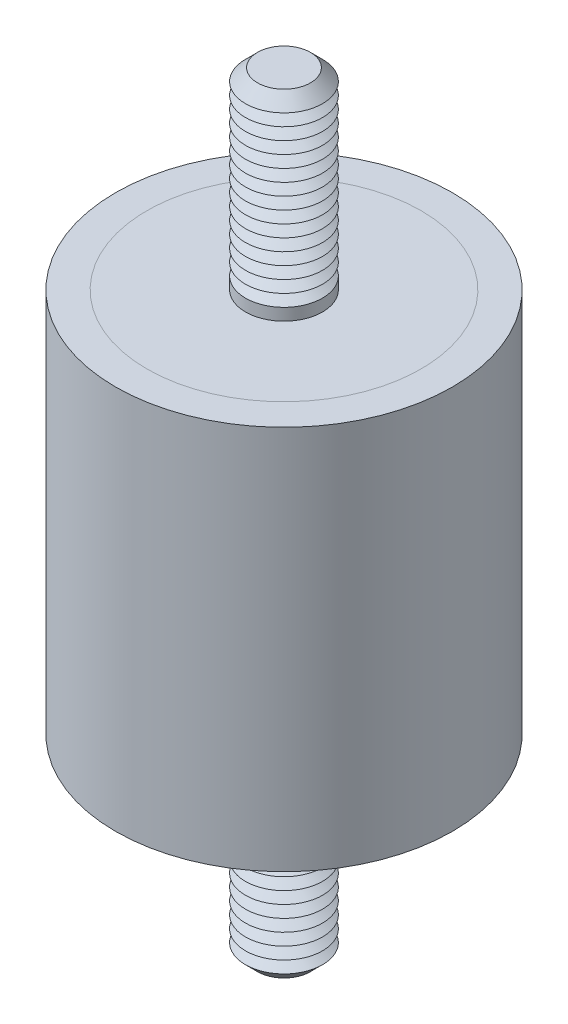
ISO-10303-21;
HEADER;
FILE_DESCRIPTION(('STEP AP214'),'2;1');
FILE_NAME('part.step','',(''),(''),'','','');
FILE_SCHEMA(('AUTOMOTIVE_DESIGN { 1 0 10303 214 1 1 1 1 }'));
ENDSEC;
DATA;
#1=APPLICATION_CONTEXT('core data for automotive mechanical design processes');
#2=APPLICATION_PROTOCOL_DEFINITION('international standard','automotive_design',2000,#1);
#3=PRODUCT_CONTEXT('',#1,'mechanical');
#4=PRODUCT('Part','Part','',(#3));
#5=PRODUCT_RELATED_PRODUCT_CATEGORY('part','',(#4));
#6=PRODUCT_DEFINITION_FORMATION('','',#4);
#7=PRODUCT_DEFINITION_CONTEXT('part definition',#1,'design');
#8=PRODUCT_DEFINITION('design','',#6,#7);
#9=PRODUCT_DEFINITION_SHAPE('','',#8);
#10=(LENGTH_UNIT() NAMED_UNIT(*) SI_UNIT(.MILLI.,.METRE.));
#11=(NAMED_UNIT(*) PLANE_ANGLE_UNIT() SI_UNIT($,.RADIAN.));
#12=(NAMED_UNIT(*) SI_UNIT($,.STERADIAN.) SOLID_ANGLE_UNIT());
#13=UNCERTAINTY_MEASURE_WITH_UNIT(LENGTH_MEASURE(1.E-05),#10,'distance_accuracy_value','');
#14=(GEOMETRIC_REPRESENTATION_CONTEXT(3) GLOBAL_UNCERTAINTY_ASSIGNED_CONTEXT((#13)) GLOBAL_UNIT_ASSIGNED_CONTEXT((#10,
#11,#12)) REPRESENTATION_CONTEXT('',''));
#15=CARTESIAN_POINT('',(0.,0.,0.));
#16=DIRECTION('',(0.,0.,1.));
#17=DIRECTION('',(1.,0.,0.));
#18=AXIS2_PLACEMENT_3D('',#15,#16,#17);
#19=CARTESIAN_POINT('',(0.,-40.,0.));
#20=DIRECTION('',(0.,1.,0.));
#21=DIRECTION('',(0.,0.,1.));
#22=AXIS2_PLACEMENT_3D('',#19,#20,#21);
#23=CYLINDRICAL_SURFACE('',#22,4.);
#24=CARTESIAN_POINT('',(0.,-20.,0.));
#25=DIRECTION('',(0.,-1.,0.));
#26=DIRECTION('',(0.,0.,-1.));
#27=AXIS2_PLACEMENT_3D('',#24,#25,#26);
#28=CIRCLE('',#27,4.);
#29=CARTESIAN_POINT('',(0.,-20.,-4.));
#30=VERTEX_POINT('',#29);
#31=EDGE_CURVE('P0_E21',#30,#30,#28,.T.);
#32=ORIENTED_EDGE('',*,*,#31,.T.);
#33=EDGE_LOOP('',(#32));
#34=FACE_BOUND('',#33,.T.);
#35=CARTESIAN_POINT('',(0.,-21.25,0.));
#36=DIRECTION('',(0.,1.,0.));
#37=DIRECTION('',(0.,0.,1.));
#38=AXIS2_PLACEMENT_3D('',#35,#36,#37);
#39=CIRCLE('',#38,4.);
#40=CARTESIAN_POINT('',(0.,-21.25,4.));
#41=VERTEX_POINT('',#40);
#42=EDGE_CURVE('P0_E33',#41,#41,#39,.T.);
#43=ORIENTED_EDGE('',*,*,#42,.T.);
#44=EDGE_LOOP('',(#43));
#45=FACE_BOUND('',#44,.T.);
#46=ADVANCED_FACE('P0_F14',(#34,#45),#23,.T.);
#47=CARTESIAN_POINT('',(0.,-20.,0.));
#48=DIRECTION('',(0.,1.,0.));
#49=DIRECTION('',(0.,0.,1.));
#50=AXIS2_PLACEMENT_3D('',#47,#48,#49);
#51=CYLINDRICAL_SURFACE('',#50,14.25);
#52=CARTESIAN_POINT('',(0.,-20.,0.));
#53=DIRECTION('',(0.,1.,0.));
#54=DIRECTION('',(0.,0.,1.));
#55=AXIS2_PLACEMENT_3D('',#52,#53,#54);
#56=CIRCLE('',#55,14.25);
#57=CARTESIAN_POINT('',(0.,-20.,14.25));
#58=VERTEX_POINT('',#57);
#59=EDGE_CURVE('P0_E25',#58,#58,#56,.T.);
#60=ORIENTED_EDGE('',*,*,#59,.T.);
#61=EDGE_LOOP('',(#60));
#62=FACE_BOUND('',#61,.T.);
#63=CARTESIAN_POINT('',(0.,-18.5,0.));
#64=DIRECTION('',(0.,1.,0.));
#65=DIRECTION('',(0.,0.,1.));
#66=AXIS2_PLACEMENT_3D('',#63,#64,#65);
#67=CIRCLE('',#66,14.25);
#68=CARTESIAN_POINT('',(0.,-18.5,14.25));
#69=VERTEX_POINT('',#68);
#70=EDGE_CURVE('P0_E30',#69,#69,#67,.T.);
#71=ORIENTED_EDGE('',*,*,#70,.F.);
#72=EDGE_LOOP('',(#71));
#73=FACE_BOUND('',#72,.T.);
#74=ADVANCED_FACE('P0_F145',(#62,#73),#51,.T.);
#75=CARTESIAN_POINT('',(0.,-20.,0.));
#76=DIRECTION('',(0.,1.,0.));
#77=DIRECTION('',(0.,0.,1.));
#78=AXIS2_PLACEMENT_3D('',#75,#76,#77);
#79=PLANE('',#78);
#80=ORIENTED_EDGE('',*,*,#31,.F.);
#81=EDGE_LOOP('',(#80));
#82=FACE_BOUND('',#81,.T.);
#83=ORIENTED_EDGE('',*,*,#59,.F.);
#84=EDGE_LOOP('',(#83));
#85=FACE_BOUND('',#84,.T.);
#86=ADVANCED_FACE('P0_F150',(#82,#85),#79,.F.);
#87=CARTESIAN_POINT('',(0.,-18.5,0.));
#88=DIRECTION('',(0.,1.,0.));
#89=DIRECTION('',(0.,0.,1.));
#90=AXIS2_PLACEMENT_3D('',#87,#88,#89);
#91=PLANE('',#90);
#92=ORIENTED_EDGE('',*,*,#70,.T.);
#93=EDGE_LOOP('',(#92));
#94=FACE_BOUND('',#93,.T.);
#95=ADVANCED_FACE('P0_F156',(#94),#91,.T.);
#96=CARTESIAN_POINT('',(0.,-21.25,0.));
#97=DIRECTION('',(0.,1.,0.));
#98=DIRECTION('',(0.,0.,1.));
#99=AXIS2_PLACEMENT_3D('',#96,#97,#98);
#100=CONICAL_SURFACE('',#99,4.,1.0471975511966);
#101=CARTESIAN_POINT('',(0.,-21.875,0.));
#102=DIRECTION('',(0.,1.,0.));
#103=DIRECTION('',(0.,0.,1.));
#104=AXIS2_PLACEMENT_3D('',#101,#102,#103);
#105=CIRCLE('',#104,2.91746824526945);
#106=CARTESIAN_POINT('',(0.,-21.875,2.91746824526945));
#107=VERTEX_POINT('',#106);
#108=EDGE_CURVE('P0_E39',#107,#107,#105,.T.);
#109=ORIENTED_EDGE('',*,*,#108,.T.);
#110=EDGE_LOOP('',(#109));
#111=FACE_BOUND('',#110,.T.);
#112=ORIENTED_EDGE('',*,*,#42,.F.);
#113=EDGE_LOOP('',(#112));
#114=FACE_BOUND('',#113,.T.);
#115=ADVANCED_FACE('P0_F159',(#111,#114),#100,.T.);
#116=CARTESIAN_POINT('',(0.,-21.875,0.));
#117=DIRECTION('',(0.,-1.,0.));
#118=DIRECTION('',(0.,0.,-1.));
#119=AXIS2_PLACEMENT_3D('',#116,#117,#118);
#120=CONICAL_SURFACE('',#119,2.91746824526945,1.04719755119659);
#121=CARTESIAN_POINT('',(0.,-22.5,0.));
#122=DIRECTION('',(0.,1.,0.));
#123=DIRECTION('',(0.,0.,1.));
#124=AXIS2_PLACEMENT_3D('',#121,#122,#123);
#125=CIRCLE('',#124,4.);
#126=CARTESIAN_POINT('',(0.,-22.5,4.));
#127=VERTEX_POINT('',#126);
#128=EDGE_CURVE('P0_E43',#127,#127,#125,.T.);
#129=ORIENTED_EDGE('',*,*,#128,.T.);
#130=EDGE_LOOP('',(#129));
#131=FACE_BOUND('',#130,.T.);
#132=ORIENTED_EDGE('',*,*,#108,.F.);
#133=EDGE_LOOP('',(#132));
#134=FACE_BOUND('',#133,.T.);
#135=ADVANCED_FACE('P0_F163',(#131,#134),#120,.T.);
#136=CARTESIAN_POINT('',(0.,-22.5,0.));
#137=DIRECTION('',(0.,1.,0.));
#138=DIRECTION('',(0.,0.,1.));
#139=AXIS2_PLACEMENT_3D('',#136,#137,#138);
#140=CONICAL_SURFACE('',#139,4.,1.0471975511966);
#141=CARTESIAN_POINT('',(0.,-23.125,0.));
#142=DIRECTION('',(0.,1.,0.));
#143=DIRECTION('',(0.,0.,1.));
#144=AXIS2_PLACEMENT_3D('',#141,#142,#143);
#145=CIRCLE('',#144,2.91746824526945);
#146=CARTESIAN_POINT('',(0.,-23.125,2.91746824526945));
#147=VERTEX_POINT('',#146);
#148=EDGE_CURVE('P0_E47',#147,#147,#145,.T.);
#149=ORIENTED_EDGE('',*,*,#148,.T.);
#150=EDGE_LOOP('',(#149));
#151=FACE_BOUND('',#150,.T.);
#152=ORIENTED_EDGE('',*,*,#128,.F.);
#153=EDGE_LOOP('',(#152));
#154=FACE_BOUND('',#153,.T.);
#155=ADVANCED_FACE('P0_F167',(#151,#154),#140,.T.);
#156=CARTESIAN_POINT('',(0.,-23.125,0.));
#157=DIRECTION('',(0.,-1.,0.));
#158=DIRECTION('',(0.,0.,-1.));
#159=AXIS2_PLACEMENT_3D('',#156,#157,#158);
#160=CONICAL_SURFACE('',#159,2.91746824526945,1.04719755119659);
#161=CARTESIAN_POINT('',(0.,-23.75,0.));
#162=DIRECTION('',(0.,1.,0.));
#163=DIRECTION('',(0.,0.,1.));
#164=AXIS2_PLACEMENT_3D('',#161,#162,#163);
#165=CIRCLE('',#164,4.);
#166=CARTESIAN_POINT('',(0.,-23.75,4.));
#167=VERTEX_POINT('',#166);
#168=EDGE_CURVE('P0_E52',#167,#167,#165,.T.);
#169=ORIENTED_EDGE('',*,*,#168,.T.);
#170=EDGE_LOOP('',(#169));
#171=FACE_BOUND('',#170,.T.);
#172=ORIENTED_EDGE('',*,*,#148,.F.);
#173=EDGE_LOOP('',(#172));
#174=FACE_BOUND('',#173,.T.);
#175=ADVANCED_FACE('P0_F174',(#171,#174),#160,.T.);
#176=CARTESIAN_POINT('',(0.,-23.75,0.));
#177=DIRECTION('',(0.,1.,0.));
#178=DIRECTION('',(0.,0.,1.));
#179=AXIS2_PLACEMENT_3D('',#176,#177,#178);
#180=CONICAL_SURFACE('',#179,4.,1.0471975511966);
#181=CARTESIAN_POINT('',(0.,-24.375,0.));
#182=DIRECTION('',(0.,1.,0.));
#183=DIRECTION('',(0.,0.,1.));
#184=AXIS2_PLACEMENT_3D('',#181,#182,#183);
#185=CIRCLE('',#184,2.91746824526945);
#186=CARTESIAN_POINT('',(0.,-24.375,2.91746824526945));
#187=VERTEX_POINT('',#186);
#188=EDGE_CURVE('P0_E55',#187,#187,#185,.T.);
#189=ORIENTED_EDGE('',*,*,#188,.T.);
#190=EDGE_LOOP('',(#189));
#191=FACE_BOUND('',#190,.T.);
#192=ORIENTED_EDGE('',*,*,#168,.F.);
#193=EDGE_LOOP('',(#192));
#194=FACE_BOUND('',#193,.T.);
#195=ADVANCED_FACE('P0_F178',(#191,#194),#180,.T.);
#196=CARTESIAN_POINT('',(0.,-24.375,0.));
#197=DIRECTION('',(0.,-1.,0.));
#198=DIRECTION('',(0.,0.,-1.));
#199=AXIS2_PLACEMENT_3D('',#196,#197,#198);
#200=CONICAL_SURFACE('',#199,2.91746824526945,1.04719755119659);
#201=CARTESIAN_POINT('',(0.,-25.,0.));
#202=DIRECTION('',(0.,1.,0.));
#203=DIRECTION('',(0.,0.,1.));
#204=AXIS2_PLACEMENT_3D('',#201,#202,#203);
#205=CIRCLE('',#204,4.);
#206=CARTESIAN_POINT('',(0.,-25.,4.));
#207=VERTEX_POINT('',#206);
#208=EDGE_CURVE('P0_E58',#207,#207,#205,.T.);
#209=ORIENTED_EDGE('',*,*,#208,.T.);
#210=EDGE_LOOP('',(#209));
#211=FACE_BOUND('',#210,.T.);
#212=ORIENTED_EDGE('',*,*,#188,.F.);
#213=EDGE_LOOP('',(#212));
#214=FACE_BOUND('',#213,.T.);
#215=ADVANCED_FACE('P0_F182',(#211,#214),#200,.T.);
#216=CARTESIAN_POINT('',(0.,-25.,0.));
#217=DIRECTION('',(0.,1.,0.));
#218=DIRECTION('',(0.,0.,1.));
#219=AXIS2_PLACEMENT_3D('',#216,#217,#218);
#220=CONICAL_SURFACE('',#219,4.,1.0471975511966);
#221=CARTESIAN_POINT('',(0.,-25.625,0.));
#222=DIRECTION('',(0.,1.,0.));
#223=DIRECTION('',(0.,0.,1.));
#224=AXIS2_PLACEMENT_3D('',#221,#222,#223);
#225=CIRCLE('',#224,2.91746824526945);
#226=CARTESIAN_POINT('',(0.,-25.625,2.91746824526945));
#227=VERTEX_POINT('',#226);
#228=EDGE_CURVE('P0_E61',#227,#227,#225,.T.);
#229=ORIENTED_EDGE('',*,*,#228,.T.);
#230=EDGE_LOOP('',(#229));
#231=FACE_BOUND('',#230,.T.);
#232=ORIENTED_EDGE('',*,*,#208,.F.);
#233=EDGE_LOOP('',(#232));
#234=FACE_BOUND('',#233,.T.);
#235=ADVANCED_FACE('P0_F186',(#231,#234),#220,.T.);
#236=CARTESIAN_POINT('',(0.,-25.625,0.));
#237=DIRECTION('',(0.,-1.,0.));
#238=DIRECTION('',(0.,0.,-1.));
#239=AXIS2_PLACEMENT_3D('',#236,#237,#238);
#240=CONICAL_SURFACE('',#239,2.91746824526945,1.04719755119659);
#241=CARTESIAN_POINT('',(0.,-26.25,0.));
#242=DIRECTION('',(0.,1.,0.));
#243=DIRECTION('',(0.,0.,1.));
#244=AXIS2_PLACEMENT_3D('',#241,#242,#243);
#245=CIRCLE('',#244,4.);
#246=CARTESIAN_POINT('',(0.,-26.25,4.));
#247=VERTEX_POINT('',#246);
#248=EDGE_CURVE('P0_E64',#247,#247,#245,.T.);
#249=ORIENTED_EDGE('',*,*,#248,.T.);
#250=EDGE_LOOP('',(#249));
#251=FACE_BOUND('',#250,.T.);
#252=ORIENTED_EDGE('',*,*,#228,.F.);
#253=EDGE_LOOP('',(#252));
#254=FACE_BOUND('',#253,.T.);
#255=ADVANCED_FACE('P0_F190',(#251,#254),#240,.T.);
#256=CARTESIAN_POINT('',(0.,-26.25,0.));
#257=DIRECTION('',(0.,1.,0.));
#258=DIRECTION('',(0.,0.,1.));
#259=AXIS2_PLACEMENT_3D('',#256,#257,#258);
#260=CONICAL_SURFACE('',#259,4.,1.0471975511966);
#261=CARTESIAN_POINT('',(0.,-26.875,0.));
#262=DIRECTION('',(0.,1.,0.));
#263=DIRECTION('',(0.,0.,1.));
#264=AXIS2_PLACEMENT_3D('',#261,#262,#263);
#265=CIRCLE('',#264,2.91746824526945);
#266=CARTESIAN_POINT('',(0.,-26.875,2.91746824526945));
#267=VERTEX_POINT('',#266);
#268=EDGE_CURVE('P0_E67',#267,#267,#265,.T.);
#269=ORIENTED_EDGE('',*,*,#268,.T.);
#270=EDGE_LOOP('',(#269));
#271=FACE_BOUND('',#270,.T.);
#272=ORIENTED_EDGE('',*,*,#248,.F.);
#273=EDGE_LOOP('',(#272));
#274=FACE_BOUND('',#273,.T.);
#275=ADVANCED_FACE('P0_F194',(#271,#274),#260,.T.);
#276=CARTESIAN_POINT('',(0.,-26.875,0.));
#277=DIRECTION('',(0.,-1.,0.));
#278=DIRECTION('',(0.,0.,-1.));
#279=AXIS2_PLACEMENT_3D('',#276,#277,#278);
#280=CONICAL_SURFACE('',#279,2.91746824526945,1.04719755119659);
#281=CARTESIAN_POINT('',(0.,-27.5,0.));
#282=DIRECTION('',(0.,1.,0.));
#283=DIRECTION('',(0.,0.,1.));
#284=AXIS2_PLACEMENT_3D('',#281,#282,#283);
#285=CIRCLE('',#284,4.);
#286=CARTESIAN_POINT('',(0.,-27.5,4.));
#287=VERTEX_POINT('',#286);
#288=EDGE_CURVE('P0_E70',#287,#287,#285,.T.);
#289=ORIENTED_EDGE('',*,*,#288,.T.);
#290=EDGE_LOOP('',(#289));
#291=FACE_BOUND('',#290,.T.);
#292=ORIENTED_EDGE('',*,*,#268,.F.);
#293=EDGE_LOOP('',(#292));
#294=FACE_BOUND('',#293,.T.);
#295=ADVANCED_FACE('P0_F198',(#291,#294),#280,.T.);
#296=CARTESIAN_POINT('',(0.,-27.5,0.));
#297=DIRECTION('',(0.,1.,0.));
#298=DIRECTION('',(0.,0.,1.));
#299=AXIS2_PLACEMENT_3D('',#296,#297,#298);
#300=CONICAL_SURFACE('',#299,4.,1.0471975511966);
#301=CARTESIAN_POINT('',(0.,-28.125,0.));
#302=DIRECTION('',(0.,1.,0.));
#303=DIRECTION('',(0.,0.,1.));
#304=AXIS2_PLACEMENT_3D('',#301,#302,#303);
#305=CIRCLE('',#304,2.91746824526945);
#306=CARTESIAN_POINT('',(0.,-28.125,2.91746824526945));
#307=VERTEX_POINT('',#306);
#308=EDGE_CURVE('P0_E73',#307,#307,#305,.T.);
#309=ORIENTED_EDGE('',*,*,#308,.T.);
#310=EDGE_LOOP('',(#309));
#311=FACE_BOUND('',#310,.T.);
#312=ORIENTED_EDGE('',*,*,#288,.F.);
#313=EDGE_LOOP('',(#312));
#314=FACE_BOUND('',#313,.T.);
#315=ADVANCED_FACE('P0_F202',(#311,#314),#300,.T.);
#316=CARTESIAN_POINT('',(0.,-28.125,0.));
#317=DIRECTION('',(0.,-1.,0.));
#318=DIRECTION('',(0.,0.,-1.));
#319=AXIS2_PLACEMENT_3D('',#316,#317,#318);
#320=CONICAL_SURFACE('',#319,2.91746824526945,1.04719755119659);
#321=CARTESIAN_POINT('',(0.,-28.75,0.));
#322=DIRECTION('',(0.,1.,0.));
#323=DIRECTION('',(0.,0.,1.));
#324=AXIS2_PLACEMENT_3D('',#321,#322,#323);
#325=CIRCLE('',#324,4.);
#326=CARTESIAN_POINT('',(0.,-28.75,4.));
#327=VERTEX_POINT('',#326);
#328=EDGE_CURVE('P0_E76',#327,#327,#325,.T.);
#329=ORIENTED_EDGE('',*,*,#328,.T.);
#330=EDGE_LOOP('',(#329));
#331=FACE_BOUND('',#330,.T.);
#332=ORIENTED_EDGE('',*,*,#308,.F.);
#333=EDGE_LOOP('',(#332));
#334=FACE_BOUND('',#333,.T.);
#335=ADVANCED_FACE('P0_F206',(#331,#334),#320,.T.);
#336=CARTESIAN_POINT('',(0.,-28.75,0.));
#337=DIRECTION('',(0.,1.,0.));
#338=DIRECTION('',(0.,0.,1.));
#339=AXIS2_PLACEMENT_3D('',#336,#337,#338);
#340=CONICAL_SURFACE('',#339,4.,1.0471975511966);
#341=CARTESIAN_POINT('',(0.,-29.375,0.));
#342=DIRECTION('',(0.,1.,0.));
#343=DIRECTION('',(0.,0.,1.));
#344=AXIS2_PLACEMENT_3D('',#341,#342,#343);
#345=CIRCLE('',#344,2.91746824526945);
#346=CARTESIAN_POINT('',(0.,-29.375,2.91746824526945));
#347=VERTEX_POINT('',#346);
#348=EDGE_CURVE('P0_E79',#347,#347,#345,.T.);
#349=ORIENTED_EDGE('',*,*,#348,.T.);
#350=EDGE_LOOP('',(#349));
#351=FACE_BOUND('',#350,.T.);
#352=ORIENTED_EDGE('',*,*,#328,.F.);
#353=EDGE_LOOP('',(#352));
#354=FACE_BOUND('',#353,.T.);
#355=ADVANCED_FACE('P0_F210',(#351,#354),#340,.T.);
#356=CARTESIAN_POINT('',(0.,-29.375,0.));
#357=DIRECTION('',(0.,-1.,0.));
#358=DIRECTION('',(0.,0.,-1.));
#359=AXIS2_PLACEMENT_3D('',#356,#357,#358);
#360=CONICAL_SURFACE('',#359,2.91746824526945,1.04719755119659);
#361=CARTESIAN_POINT('',(0.,-30.,0.));
#362=DIRECTION('',(0.,1.,0.));
#363=DIRECTION('',(0.,0.,1.));
#364=AXIS2_PLACEMENT_3D('',#361,#362,#363);
#365=CIRCLE('',#364,4.);
#366=CARTESIAN_POINT('',(0.,-30.,4.));
#367=VERTEX_POINT('',#366);
#368=EDGE_CURVE('P0_E82',#367,#367,#365,.T.);
#369=ORIENTED_EDGE('',*,*,#368,.T.);
#370=EDGE_LOOP('',(#369));
#371=FACE_BOUND('',#370,.T.);
#372=ORIENTED_EDGE('',*,*,#348,.F.);
#373=EDGE_LOOP('',(#372));
#374=FACE_BOUND('',#373,.T.);
#375=ADVANCED_FACE('P0_F214',(#371,#374),#360,.T.);
#376=CARTESIAN_POINT('',(0.,-30.,0.));
#377=DIRECTION('',(0.,1.,0.));
#378=DIRECTION('',(0.,0.,1.));
#379=AXIS2_PLACEMENT_3D('',#376,#377,#378);
#380=CONICAL_SURFACE('',#379,4.,1.0471975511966);
#381=CARTESIAN_POINT('',(0.,-30.625,0.));
#382=DIRECTION('',(0.,1.,0.));
#383=DIRECTION('',(0.,0.,1.));
#384=AXIS2_PLACEMENT_3D('',#381,#382,#383);
#385=CIRCLE('',#384,2.91746824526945);
#386=CARTESIAN_POINT('',(0.,-30.625,2.91746824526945));
#387=VERTEX_POINT('',#386);
#388=EDGE_CURVE('P0_E85',#387,#387,#385,.T.);
#389=ORIENTED_EDGE('',*,*,#388,.T.);
#390=EDGE_LOOP('',(#389));
#391=FACE_BOUND('',#390,.T.);
#392=ORIENTED_EDGE('',*,*,#368,.F.);
#393=EDGE_LOOP('',(#392));
#394=FACE_BOUND('',#393,.T.);
#395=ADVANCED_FACE('P0_F218',(#391,#394),#380,.T.);
#396=CARTESIAN_POINT('',(0.,-30.625,0.));
#397=DIRECTION('',(0.,-1.,0.));
#398=DIRECTION('',(0.,0.,-1.));
#399=AXIS2_PLACEMENT_3D('',#396,#397,#398);
#400=CONICAL_SURFACE('',#399,2.91746824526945,1.04719755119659);
#401=CARTESIAN_POINT('',(0.,-31.25,0.));
#402=DIRECTION('',(0.,1.,0.));
#403=DIRECTION('',(0.,0.,1.));
#404=AXIS2_PLACEMENT_3D('',#401,#402,#403);
#405=CIRCLE('',#404,4.);
#406=CARTESIAN_POINT('',(0.,-31.25,4.));
#407=VERTEX_POINT('',#406);
#408=EDGE_CURVE('P0_E88',#407,#407,#405,.T.);
#409=ORIENTED_EDGE('',*,*,#408,.T.);
#410=EDGE_LOOP('',(#409));
#411=FACE_BOUND('',#410,.T.);
#412=ORIENTED_EDGE('',*,*,#388,.F.);
#413=EDGE_LOOP('',(#412));
#414=FACE_BOUND('',#413,.T.);
#415=ADVANCED_FACE('P0_F222',(#411,#414),#400,.T.);
#416=CARTESIAN_POINT('',(0.,-31.25,0.));
#417=DIRECTION('',(0.,1.,0.));
#418=DIRECTION('',(0.,0.,1.));
#419=AXIS2_PLACEMENT_3D('',#416,#417,#418);
#420=CONICAL_SURFACE('',#419,4.,1.0471975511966);
#421=CARTESIAN_POINT('',(0.,-31.875,0.));
#422=DIRECTION('',(0.,1.,0.));
#423=DIRECTION('',(0.,0.,1.));
#424=AXIS2_PLACEMENT_3D('',#421,#422,#423);
#425=CIRCLE('',#424,2.91746824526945);
#426=CARTESIAN_POINT('',(0.,-31.875,2.91746824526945));
#427=VERTEX_POINT('',#426);
#428=EDGE_CURVE('P0_E91',#427,#427,#425,.T.);
#429=ORIENTED_EDGE('',*,*,#428,.T.);
#430=EDGE_LOOP('',(#429));
#431=FACE_BOUND('',#430,.T.);
#432=ORIENTED_EDGE('',*,*,#408,.F.);
#433=EDGE_LOOP('',(#432));
#434=FACE_BOUND('',#433,.T.);
#435=ADVANCED_FACE('P0_F226',(#431,#434),#420,.T.);
#436=CARTESIAN_POINT('',(0.,-31.875,0.));
#437=DIRECTION('',(0.,-1.,0.));
#438=DIRECTION('',(0.,0.,-1.));
#439=AXIS2_PLACEMENT_3D('',#436,#437,#438);
#440=CONICAL_SURFACE('',#439,2.91746824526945,1.04719755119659);
#441=CARTESIAN_POINT('',(0.,-32.5,0.));
#442=DIRECTION('',(0.,1.,0.));
#443=DIRECTION('',(0.,0.,1.));
#444=AXIS2_PLACEMENT_3D('',#441,#442,#443);
#445=CIRCLE('',#444,4.);
#446=CARTESIAN_POINT('',(0.,-32.5,4.));
#447=VERTEX_POINT('',#446);
#448=EDGE_CURVE('P0_E94',#447,#447,#445,.T.);
#449=ORIENTED_EDGE('',*,*,#448,.T.);
#450=EDGE_LOOP('',(#449));
#451=FACE_BOUND('',#450,.T.);
#452=ORIENTED_EDGE('',*,*,#428,.F.);
#453=EDGE_LOOP('',(#452));
#454=FACE_BOUND('',#453,.T.);
#455=ADVANCED_FACE('P0_F230',(#451,#454),#440,.T.);
#456=CARTESIAN_POINT('',(0.,-32.5,0.));
#457=DIRECTION('',(0.,1.,0.));
#458=DIRECTION('',(0.,0.,1.));
#459=AXIS2_PLACEMENT_3D('',#456,#457,#458);
#460=CONICAL_SURFACE('',#459,4.,1.0471975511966);
#461=CARTESIAN_POINT('',(0.,-33.125,0.));
#462=DIRECTION('',(0.,1.,0.));
#463=DIRECTION('',(0.,0.,1.));
#464=AXIS2_PLACEMENT_3D('',#461,#462,#463);
#465=CIRCLE('',#464,2.91746824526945);
#466=CARTESIAN_POINT('',(0.,-33.125,2.91746824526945));
#467=VERTEX_POINT('',#466);
#468=EDGE_CURVE('P0_E97',#467,#467,#465,.T.);
#469=ORIENTED_EDGE('',*,*,#468,.T.);
#470=EDGE_LOOP('',(#469));
#471=FACE_BOUND('',#470,.T.);
#472=ORIENTED_EDGE('',*,*,#448,.F.);
#473=EDGE_LOOP('',(#472));
#474=FACE_BOUND('',#473,.T.);
#475=ADVANCED_FACE('P0_F234',(#471,#474),#460,.T.);
#476=CARTESIAN_POINT('',(0.,-33.125,0.));
#477=DIRECTION('',(0.,-1.,0.));
#478=DIRECTION('',(0.,0.,-1.));
#479=AXIS2_PLACEMENT_3D('',#476,#477,#478);
#480=CONICAL_SURFACE('',#479,2.91746824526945,1.04719755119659);
#481=CARTESIAN_POINT('',(0.,-33.75,0.));
#482=DIRECTION('',(0.,1.,0.));
#483=DIRECTION('',(0.,0.,1.));
#484=AXIS2_PLACEMENT_3D('',#481,#482,#483);
#485=CIRCLE('',#484,4.);
#486=CARTESIAN_POINT('',(0.,-33.75,4.));
#487=VERTEX_POINT('',#486);
#488=EDGE_CURVE('P0_E100',#487,#487,#485,.T.);
#489=ORIENTED_EDGE('',*,*,#488,.T.);
#490=EDGE_LOOP('',(#489));
#491=FACE_BOUND('',#490,.T.);
#492=ORIENTED_EDGE('',*,*,#468,.F.);
#493=EDGE_LOOP('',(#492));
#494=FACE_BOUND('',#493,.T.);
#495=ADVANCED_FACE('P0_F238',(#491,#494),#480,.T.);
#496=CARTESIAN_POINT('',(0.,-33.75,0.));
#497=DIRECTION('',(0.,1.,0.));
#498=DIRECTION('',(0.,0.,1.));
#499=AXIS2_PLACEMENT_3D('',#496,#497,#498);
#500=CONICAL_SURFACE('',#499,4.,1.0471975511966);
#501=CARTESIAN_POINT('',(0.,-34.375,0.));
#502=DIRECTION('',(0.,1.,0.));
#503=DIRECTION('',(0.,0.,1.));
#504=AXIS2_PLACEMENT_3D('',#501,#502,#503);
#505=CIRCLE('',#504,2.91746824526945);
#506=CARTESIAN_POINT('',(0.,-34.375,2.91746824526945));
#507=VERTEX_POINT('',#506);
#508=EDGE_CURVE('P0_E103',#507,#507,#505,.T.);
#509=ORIENTED_EDGE('',*,*,#508,.T.);
#510=EDGE_LOOP('',(#509));
#511=FACE_BOUND('',#510,.T.);
#512=ORIENTED_EDGE('',*,*,#488,.F.);
#513=EDGE_LOOP('',(#512));
#514=FACE_BOUND('',#513,.T.);
#515=ADVANCED_FACE('P0_F242',(#511,#514),#500,.T.);
#516=CARTESIAN_POINT('',(0.,-34.375,0.));
#517=DIRECTION('',(0.,-1.,0.));
#518=DIRECTION('',(0.,0.,-1.));
#519=AXIS2_PLACEMENT_3D('',#516,#517,#518);
#520=CONICAL_SURFACE('',#519,2.91746824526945,1.04719755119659);
#521=CARTESIAN_POINT('',(0.,-35.,0.));
#522=DIRECTION('',(0.,1.,0.));
#523=DIRECTION('',(0.,0.,1.));
#524=AXIS2_PLACEMENT_3D('',#521,#522,#523);
#525=CIRCLE('',#524,4.);
#526=CARTESIAN_POINT('',(0.,-35.,4.));
#527=VERTEX_POINT('',#526);
#528=EDGE_CURVE('P0_E106',#527,#527,#525,.T.);
#529=ORIENTED_EDGE('',*,*,#528,.T.);
#530=EDGE_LOOP('',(#529));
#531=FACE_BOUND('',#530,.T.);
#532=ORIENTED_EDGE('',*,*,#508,.F.);
#533=EDGE_LOOP('',(#532));
#534=FACE_BOUND('',#533,.T.);
#535=ADVANCED_FACE('P0_F246',(#531,#534),#520,.T.);
#536=CARTESIAN_POINT('',(0.,-35.,0.));
#537=DIRECTION('',(0.,1.,0.));
#538=DIRECTION('',(0.,0.,1.));
#539=AXIS2_PLACEMENT_3D('',#536,#537,#538);
#540=CONICAL_SURFACE('',#539,4.,1.0471975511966);
#541=CARTESIAN_POINT('',(0.,-35.625,0.));
#542=DIRECTION('',(0.,1.,0.));
#543=DIRECTION('',(0.,0.,1.));
#544=AXIS2_PLACEMENT_3D('',#541,#542,#543);
#545=CIRCLE('',#544,2.91746824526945);
#546=CARTESIAN_POINT('',(0.,-35.625,2.91746824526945));
#547=VERTEX_POINT('',#546);
#548=EDGE_CURVE('P0_E109',#547,#547,#545,.T.);
#549=ORIENTED_EDGE('',*,*,#548,.T.);
#550=EDGE_LOOP('',(#549));
#551=FACE_BOUND('',#550,.T.);
#552=ORIENTED_EDGE('',*,*,#528,.F.);
#553=EDGE_LOOP('',(#552));
#554=FACE_BOUND('',#553,.T.);
#555=ADVANCED_FACE('P0_F250',(#551,#554),#540,.T.);
#556=CARTESIAN_POINT('',(0.,-35.625,0.));
#557=DIRECTION('',(0.,-1.,0.));
#558=DIRECTION('',(0.,0.,-1.));
#559=AXIS2_PLACEMENT_3D('',#556,#557,#558);
#560=CONICAL_SURFACE('',#559,2.91746824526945,1.04719755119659);
#561=CARTESIAN_POINT('',(0.,-36.25,0.));
#562=DIRECTION('',(0.,1.,0.));
#563=DIRECTION('',(0.,0.,1.));
#564=AXIS2_PLACEMENT_3D('',#561,#562,#563);
#565=CIRCLE('',#564,4.);
#566=CARTESIAN_POINT('',(0.,-36.25,4.));
#567=VERTEX_POINT('',#566);
#568=EDGE_CURVE('P0_E112',#567,#567,#565,.T.);
#569=ORIENTED_EDGE('',*,*,#568,.T.);
#570=EDGE_LOOP('',(#569));
#571=FACE_BOUND('',#570,.T.);
#572=ORIENTED_EDGE('',*,*,#548,.F.);
#573=EDGE_LOOP('',(#572));
#574=FACE_BOUND('',#573,.T.);
#575=ADVANCED_FACE('P0_F254',(#571,#574),#560,.T.);
#576=CARTESIAN_POINT('',(0.,-36.25,0.));
#577=DIRECTION('',(0.,1.,0.));
#578=DIRECTION('',(0.,0.,1.));
#579=AXIS2_PLACEMENT_3D('',#576,#577,#578);
#580=CONICAL_SURFACE('',#579,4.,1.0471975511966);
#581=CARTESIAN_POINT('',(0.,-36.875,0.));
#582=DIRECTION('',(0.,1.,0.));
#583=DIRECTION('',(0.,0.,1.));
#584=AXIS2_PLACEMENT_3D('',#581,#582,#583);
#585=CIRCLE('',#584,2.91746824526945);
#586=CARTESIAN_POINT('',(0.,-36.875,2.91746824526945));
#587=VERTEX_POINT('',#586);
#588=EDGE_CURVE('P0_E115',#587,#587,#585,.T.);
#589=ORIENTED_EDGE('',*,*,#588,.T.);
#590=EDGE_LOOP('',(#589));
#591=FACE_BOUND('',#590,.T.);
#592=ORIENTED_EDGE('',*,*,#568,.F.);
#593=EDGE_LOOP('',(#592));
#594=FACE_BOUND('',#593,.T.);
#595=ADVANCED_FACE('P0_F258',(#591,#594),#580,.T.);
#596=CARTESIAN_POINT('',(0.,-36.875,0.));
#597=DIRECTION('',(0.,-1.,0.));
#598=DIRECTION('',(0.,0.,-1.));
#599=AXIS2_PLACEMENT_3D('',#596,#597,#598);
#600=CONICAL_SURFACE('',#599,2.91746824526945,1.04719755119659);
#601=CARTESIAN_POINT('',(0.,-37.5,0.));
#602=DIRECTION('',(0.,1.,0.));
#603=DIRECTION('',(0.,0.,1.));
#604=AXIS2_PLACEMENT_3D('',#601,#602,#603);
#605=CIRCLE('',#604,4.);
#606=CARTESIAN_POINT('',(0.,-37.5,4.));
#607=VERTEX_POINT('',#606);
#608=EDGE_CURVE('P0_E118',#607,#607,#605,.T.);
#609=ORIENTED_EDGE('',*,*,#608,.T.);
#610=EDGE_LOOP('',(#609));
#611=FACE_BOUND('',#610,.T.);
#612=ORIENTED_EDGE('',*,*,#588,.F.);
#613=EDGE_LOOP('',(#612));
#614=FACE_BOUND('',#613,.T.);
#615=ADVANCED_FACE('P0_F142',(#611,#614),#600,.T.);
#616=CARTESIAN_POINT('',(0.,-37.5,0.));
#617=DIRECTION('',(0.,1.,0.));
#618=DIRECTION('',(0.,0.,1.));
#619=AXIS2_PLACEMENT_3D('',#616,#617,#618);
#620=CONICAL_SURFACE('',#619,4.,1.0471975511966);
#621=CARTESIAN_POINT('',(0.,-38.125,0.));
#622=DIRECTION('',(0.,1.,0.));
#623=DIRECTION('',(0.,0.,1.));
#624=AXIS2_PLACEMENT_3D('',#621,#622,#623);
#625=CIRCLE('',#624,2.91746824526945);
#626=CARTESIAN_POINT('',(0.,-38.125,2.91746824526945));
#627=VERTEX_POINT('',#626);
#628=EDGE_CURVE('P0_E124',#627,#627,#625,.T.);
#629=ORIENTED_EDGE('',*,*,#628,.T.);
#630=EDGE_LOOP('',(#629));
#631=FACE_BOUND('',#630,.T.);
#632=ORIENTED_EDGE('',*,*,#608,.F.);
#633=EDGE_LOOP('',(#632));
#634=FACE_BOUND('',#633,.T.);
#635=ADVANCED_FACE('P0_F128',(#631,#634),#620,.T.);
#636=CARTESIAN_POINT('',(0.,-38.125,0.));
#637=DIRECTION('',(0.,-1.,0.));
#638=DIRECTION('',(0.,0.,-1.));
#639=AXIS2_PLACEMENT_3D('',#636,#637,#638);
#640=CONICAL_SURFACE('',#639,2.91746824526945,1.04719755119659);
#641=CARTESIAN_POINT('',(0.,-38.75,0.));
#642=DIRECTION('',(0.,1.,0.));
#643=DIRECTION('',(0.,0.,1.));
#644=AXIS2_PLACEMENT_3D('',#641,#642,#643);
#645=CIRCLE('',#644,4.);
#646=CARTESIAN_POINT('',(0.,-38.75,4.));
#647=VERTEX_POINT('',#646);
#648=EDGE_CURVE('P0_E121',#647,#647,#645,.T.);
#649=ORIENTED_EDGE('',*,*,#648,.T.);
#650=EDGE_LOOP('',(#649));
#651=FACE_BOUND('',#650,.T.);
#652=ORIENTED_EDGE('',*,*,#628,.F.);
#653=EDGE_LOOP('',(#652));
#654=FACE_BOUND('',#653,.T.);
#655=ADVANCED_FACE('P0_F131',(#651,#654),#640,.T.);
#656=CARTESIAN_POINT('',(0.,-40.,0.));
#657=DIRECTION('',(0.,-1.,0.));
#658=DIRECTION('',(0.,0.,-1.));
#659=AXIS2_PLACEMENT_3D('',#656,#657,#658);
#660=PLANE('',#659);
#661=CARTESIAN_POINT('',(0.,-40.,0.));
#662=DIRECTION('',(0.,-1.,0.));
#663=DIRECTION('',(0.,0.,-1.));
#664=AXIS2_PLACEMENT_3D('',#661,#662,#663);
#665=CIRCLE('',#664,2.75000000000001);
#666=CARTESIAN_POINT('',(0.,-40.,-2.75000000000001));
#667=VERTEX_POINT('',#666);
#668=EDGE_CURVE('P0_E10',#667,#667,#665,.T.);
#669=ORIENTED_EDGE('',*,*,#668,.T.);
#670=EDGE_LOOP('',(#669));
#671=FACE_BOUND('',#670,.T.);
#672=ADVANCED_FACE('P0_F133',(#671),#660,.T.);
#673=CARTESIAN_POINT('',(0.,-40.,0.));
#674=DIRECTION('',(0.,1.,0.));
#675=DIRECTION('',(0.,0.,1.));
#676=AXIS2_PLACEMENT_3D('',#673,#674,#675);
#677=CONICAL_SURFACE('',#676,2.75000000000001,0.785398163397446);
#678=ORIENTED_EDGE('',*,*,#648,.F.);
#679=EDGE_LOOP('',(#678));
#680=FACE_BOUND('',#679,.T.);
#681=ORIENTED_EDGE('',*,*,#668,.F.);
#682=EDGE_LOOP('',(#681));
#683=FACE_BOUND('',#682,.T.);
#684=ADVANCED_FACE('P0_F16',(#680,#683),#677,.T.);
#685=CLOSED_SHELL('',(#46,#74,#86,#95,#115,#135,#155,#175,#195,#215,#235,#255,#275,#295,#315,
#335,#355,#375,#395,#415,#435,#455,#475,#495,#515,#535,#555,#575,#595,#615,#635,#655,#672,#684));
#686=MANIFOLD_SOLID_BREP('P0_B1',#685);
#687=CARTESIAN_POINT('',(0.,40.,0.));
#688=DIRECTION('',(0.,-1.,0.));
#689=DIRECTION('',(0.,0.,-1.));
#690=AXIS2_PLACEMENT_3D('',#687,#688,#689);
#691=CYLINDRICAL_SURFACE('',#690,4.);
#692=CARTESIAN_POINT('',(0.,21.25,0.));
#693=DIRECTION('',(0.,1.,0.));
#694=DIRECTION('',(0.,0.,1.));
#695=AXIS2_PLACEMENT_3D('',#692,#693,#694);
#696=CIRCLE('',#695,4.);
#697=CARTESIAN_POINT('',(0.,21.25,4.));
#698=VERTEX_POINT('',#697);
#699=EDGE_CURVE('P1_E33',#698,#698,#696,.T.);
#700=ORIENTED_EDGE('',*,*,#699,.F.);
#701=EDGE_LOOP('',(#700));
#702=FACE_BOUND('',#701,.T.);
#703=CARTESIAN_POINT('',(0.,20.,0.));
#704=DIRECTION('',(0.,1.,0.));
#705=DIRECTION('',(0.,0.,1.));
#706=AXIS2_PLACEMENT_3D('',#703,#704,#705);
#707=CIRCLE('',#706,4.);
#708=CARTESIAN_POINT('',(0.,20.,4.));
#709=VERTEX_POINT('',#708);
#710=EDGE_CURVE('P1_E21',#709,#709,#707,.T.);
#711=ORIENTED_EDGE('',*,*,#710,.T.);
#712=EDGE_LOOP('',(#711));
#713=FACE_BOUND('',#712,.T.);
#714=ADVANCED_FACE('P1_F14',(#702,#713),#691,.T.);
#715=CARTESIAN_POINT('',(0.,20.,0.));
#716=DIRECTION('',(0.,-1.,0.));
#717=DIRECTION('',(0.,0.,-1.));
#718=AXIS2_PLACEMENT_3D('',#715,#716,#717);
#719=CYLINDRICAL_SURFACE('',#718,14.25);
#720=CARTESIAN_POINT('',(0.,20.,0.));
#721=DIRECTION('',(0.,1.,0.));
#722=DIRECTION('',(0.,0.,1.));
#723=AXIS2_PLACEMENT_3D('',#720,#721,#722);
#724=CIRCLE('',#723,14.25);
#725=CARTESIAN_POINT('',(0.,20.,14.25));
#726=VERTEX_POINT('',#725);
#727=EDGE_CURVE('P1_E25',#726,#726,#724,.T.);
#728=ORIENTED_EDGE('',*,*,#727,.F.);
#729=EDGE_LOOP('',(#728));
#730=FACE_BOUND('',#729,.T.);
#731=CARTESIAN_POINT('',(0.,18.5,0.));
#732=DIRECTION('',(0.,1.,0.));
#733=DIRECTION('',(0.,0.,1.));
#734=AXIS2_PLACEMENT_3D('',#731,#732,#733);
#735=CIRCLE('',#734,14.25);
#736=CARTESIAN_POINT('',(0.,18.5,14.25));
#737=VERTEX_POINT('',#736);
#738=EDGE_CURVE('P1_E30',#737,#737,#735,.T.);
#739=ORIENTED_EDGE('',*,*,#738,.T.);
#740=EDGE_LOOP('',(#739));
#741=FACE_BOUND('',#740,.T.);
#742=ADVANCED_FACE('P1_F292',(#730,#741),#719,.T.);
#743=CARTESIAN_POINT('',(0.,20.,0.));
#744=DIRECTION('',(0.,1.,0.));
#745=DIRECTION('',(0.,0.,1.));
#746=AXIS2_PLACEMENT_3D('',#743,#744,#745);
#747=PLANE('',#746);
#748=ORIENTED_EDGE('',*,*,#710,.F.);
#749=EDGE_LOOP('',(#748));
#750=FACE_BOUND('',#749,.T.);
#751=ORIENTED_EDGE('',*,*,#727,.T.);
#752=EDGE_LOOP('',(#751));
#753=FACE_BOUND('',#752,.T.);
#754=ADVANCED_FACE('P1_F298',(#750,#753),#747,.T.);
#755=CARTESIAN_POINT('',(0.,18.5,0.));
#756=DIRECTION('',(0.,1.,0.));
#757=DIRECTION('',(0.,0.,1.));
#758=AXIS2_PLACEMENT_3D('',#755,#756,#757);
#759=PLANE('',#758);
#760=ORIENTED_EDGE('',*,*,#738,.F.);
#761=EDGE_LOOP('',(#760));
#762=FACE_BOUND('',#761,.T.);
#763=ADVANCED_FACE('P1_F288',(#762),#759,.F.);
#764=CARTESIAN_POINT('',(0.,21.25,0.));
#765=DIRECTION('',(0.,-1.,0.));
#766=DIRECTION('',(0.,0.,-1.));
#767=AXIS2_PLACEMENT_3D('',#764,#765,#766);
#768=CONICAL_SURFACE('',#767,4.,1.0471975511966);
#769=CARTESIAN_POINT('',(0.,21.875,0.));
#770=DIRECTION('',(0.,1.,0.));
#771=DIRECTION('',(0.,0.,1.));
#772=AXIS2_PLACEMENT_3D('',#769,#770,#771);
#773=CIRCLE('',#772,2.91746824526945);
#774=CARTESIAN_POINT('',(0.,21.875,2.91746824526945));
#775=VERTEX_POINT('',#774);
#776=EDGE_CURVE('P1_E39',#775,#775,#773,.T.);
#777=ORIENTED_EDGE('',*,*,#776,.F.);
#778=EDGE_LOOP('',(#777));
#779=FACE_BOUND('',#778,.T.);
#780=ORIENTED_EDGE('',*,*,#699,.T.);
#781=EDGE_LOOP('',(#780));
#782=FACE_BOUND('',#781,.T.);
#783=ADVANCED_FACE('P1_F282',(#779,#782),#768,.T.);
#784=CARTESIAN_POINT('',(0.,21.875,0.));
#785=DIRECTION('',(0.,1.,0.));
#786=DIRECTION('',(0.,0.,1.));
#787=AXIS2_PLACEMENT_3D('',#784,#785,#786);
#788=CONICAL_SURFACE('',#787,2.91746824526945,1.04719755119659);
#789=CARTESIAN_POINT('',(0.,22.5,0.));
#790=DIRECTION('',(0.,1.,0.));
#791=DIRECTION('',(0.,0.,1.));
#792=AXIS2_PLACEMENT_3D('',#789,#790,#791);
#793=CIRCLE('',#792,4.);
#794=CARTESIAN_POINT('',(0.,22.5,4.));
#795=VERTEX_POINT('',#794);
#796=EDGE_CURVE('P1_E43',#795,#795,#793,.T.);
#797=ORIENTED_EDGE('',*,*,#796,.F.);
#798=EDGE_LOOP('',(#797));
#799=FACE_BOUND('',#798,.T.);
#800=ORIENTED_EDGE('',*,*,#776,.T.);
#801=EDGE_LOOP('',(#800));
#802=FACE_BOUND('',#801,.T.);
#803=ADVANCED_FACE('P1_F277',(#799,#802),#788,.T.);
#804=CARTESIAN_POINT('',(0.,22.5,0.));
#805=DIRECTION('',(0.,-1.,0.));
#806=DIRECTION('',(0.,0.,-1.));
#807=AXIS2_PLACEMENT_3D('',#804,#805,#806);
#808=CONICAL_SURFACE('',#807,4.,1.0471975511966);
#809=CARTESIAN_POINT('',(0.,23.125,0.));
#810=DIRECTION('',(0.,1.,0.));
#811=DIRECTION('',(0.,0.,1.));
#812=AXIS2_PLACEMENT_3D('',#809,#810,#811);
#813=CIRCLE('',#812,2.91746824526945);
#814=CARTESIAN_POINT('',(0.,23.125,2.91746824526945));
#815=VERTEX_POINT('',#814);
#816=EDGE_CURVE('P1_E47',#815,#815,#813,.T.);
#817=ORIENTED_EDGE('',*,*,#816,.F.);
#818=EDGE_LOOP('',(#817));
#819=FACE_BOUND('',#818,.T.);
#820=ORIENTED_EDGE('',*,*,#796,.T.);
#821=EDGE_LOOP('',(#820));
#822=FACE_BOUND('',#821,.T.);
#823=ADVANCED_FACE('P1_F271',(#819,#822),#808,.T.);
#824=CARTESIAN_POINT('',(0.,23.125,0.));
#825=DIRECTION('',(0.,1.,0.));
#826=DIRECTION('',(0.,0.,1.));
#827=AXIS2_PLACEMENT_3D('',#824,#825,#826);
#828=CONICAL_SURFACE('',#827,2.91746824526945,1.04719755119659);
#829=CARTESIAN_POINT('',(0.,23.75,0.));
#830=DIRECTION('',(0.,1.,0.));
#831=DIRECTION('',(0.,0.,1.));
#832=AXIS2_PLACEMENT_3D('',#829,#830,#831);
#833=CIRCLE('',#832,4.);
#834=CARTESIAN_POINT('',(0.,23.75,4.));
#835=VERTEX_POINT('',#834);
#836=EDGE_CURVE('P1_E52',#835,#835,#833,.T.);
#837=ORIENTED_EDGE('',*,*,#836,.F.);
#838=EDGE_LOOP('',(#837));
#839=FACE_BOUND('',#838,.T.);
#840=ORIENTED_EDGE('',*,*,#816,.T.);
#841=EDGE_LOOP('',(#840));
#842=FACE_BOUND('',#841,.T.);
#843=ADVANCED_FACE('P1_F265',(#839,#842),#828,.T.);
#844=CARTESIAN_POINT('',(0.,23.75,0.));
#845=DIRECTION('',(0.,-1.,0.));
#846=DIRECTION('',(0.,0.,-1.));
#847=AXIS2_PLACEMENT_3D('',#844,#845,#846);
#848=CONICAL_SURFACE('',#847,4.,1.0471975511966);
#849=CARTESIAN_POINT('',(0.,24.375,0.));
#850=DIRECTION('',(0.,1.,0.));
#851=DIRECTION('',(0.,0.,1.));
#852=AXIS2_PLACEMENT_3D('',#849,#850,#851);
#853=CIRCLE('',#852,2.91746824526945);
#854=CARTESIAN_POINT('',(0.,24.375,2.91746824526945));
#855=VERTEX_POINT('',#854);
#856=EDGE_CURVE('P1_E55',#855,#855,#853,.T.);
#857=ORIENTED_EDGE('',*,*,#856,.F.);
#858=EDGE_LOOP('',(#857));
#859=FACE_BOUND('',#858,.T.);
#860=ORIENTED_EDGE('',*,*,#836,.T.);
#861=EDGE_LOOP('',(#860));
#862=FACE_BOUND('',#861,.T.);
#863=ADVANCED_FACE('P1_F259',(#859,#862),#848,.T.);
#864=CARTESIAN_POINT('',(0.,24.375,0.));
#865=DIRECTION('',(0.,1.,0.));
#866=DIRECTION('',(0.,0.,1.));
#867=AXIS2_PLACEMENT_3D('',#864,#865,#866);
#868=CONICAL_SURFACE('',#867,2.91746824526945,1.04719755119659);
#869=CARTESIAN_POINT('',(0.,25.,0.));
#870=DIRECTION('',(0.,1.,0.));
#871=DIRECTION('',(0.,0.,1.));
#872=AXIS2_PLACEMENT_3D('',#869,#870,#871);
#873=CIRCLE('',#872,4.);
#874=CARTESIAN_POINT('',(0.,25.,4.));
#875=VERTEX_POINT('',#874);
#876=EDGE_CURVE('P1_E58',#875,#875,#873,.T.);
#877=ORIENTED_EDGE('',*,*,#876,.F.);
#878=EDGE_LOOP('',(#877));
#879=FACE_BOUND('',#878,.T.);
#880=ORIENTED_EDGE('',*,*,#856,.T.);
#881=EDGE_LOOP('',(#880));
#882=FACE_BOUND('',#881,.T.);
#883=ADVANCED_FACE('P1_F253',(#879,#882),#868,.T.);
#884=CARTESIAN_POINT('',(0.,25.,0.));
#885=DIRECTION('',(0.,-1.,0.));
#886=DIRECTION('',(0.,0.,-1.));
#887=AXIS2_PLACEMENT_3D('',#884,#885,#886);
#888=CONICAL_SURFACE('',#887,4.,1.0471975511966);
#889=CARTESIAN_POINT('',(0.,25.625,0.));
#890=DIRECTION('',(0.,1.,0.));
#891=DIRECTION('',(0.,0.,1.));
#892=AXIS2_PLACEMENT_3D('',#889,#890,#891);
#893=CIRCLE('',#892,2.91746824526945);
#894=CARTESIAN_POINT('',(0.,25.625,2.91746824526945));
#895=VERTEX_POINT('',#894);
#896=EDGE_CURVE('P1_E61',#895,#895,#893,.T.);
#897=ORIENTED_EDGE('',*,*,#896,.F.);
#898=EDGE_LOOP('',(#897));
#899=FACE_BOUND('',#898,.T.);
#900=ORIENTED_EDGE('',*,*,#876,.T.);
#901=EDGE_LOOP('',(#900));
#902=FACE_BOUND('',#901,.T.);
#903=ADVANCED_FACE('P1_F247',(#899,#902),#888,.T.);
#904=CARTESIAN_POINT('',(0.,25.625,0.));
#905=DIRECTION('',(0.,1.,0.));
#906=DIRECTION('',(0.,0.,1.));
#907=AXIS2_PLACEMENT_3D('',#904,#905,#906);
#908=CONICAL_SURFACE('',#907,2.91746824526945,1.04719755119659);
#909=CARTESIAN_POINT('',(0.,26.25,0.));
#910=DIRECTION('',(0.,1.,0.));
#911=DIRECTION('',(0.,0.,1.));
#912=AXIS2_PLACEMENT_3D('',#909,#910,#911);
#913=CIRCLE('',#912,4.);
#914=CARTESIAN_POINT('',(0.,26.25,4.));
#915=VERTEX_POINT('',#914);
#916=EDGE_CURVE('P1_E64',#915,#915,#913,.T.);
#917=ORIENTED_EDGE('',*,*,#916,.F.);
#918=EDGE_LOOP('',(#917));
#919=FACE_BOUND('',#918,.T.);
#920=ORIENTED_EDGE('',*,*,#896,.T.);
#921=EDGE_LOOP('',(#920));
#922=FACE_BOUND('',#921,.T.);
#923=ADVANCED_FACE('P1_F241',(#919,#922),#908,.T.);
#924=CARTESIAN_POINT('',(0.,26.25,0.));
#925=DIRECTION('',(0.,-1.,0.));
#926=DIRECTION('',(0.,0.,-1.));
#927=AXIS2_PLACEMENT_3D('',#924,#925,#926);
#928=CONICAL_SURFACE('',#927,4.,1.0471975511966);
#929=CARTESIAN_POINT('',(0.,26.875,0.));
#930=DIRECTION('',(0.,1.,0.));
#931=DIRECTION('',(0.,0.,1.));
#932=AXIS2_PLACEMENT_3D('',#929,#930,#931);
#933=CIRCLE('',#932,2.91746824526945);
#934=CARTESIAN_POINT('',(0.,26.875,2.91746824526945));
#935=VERTEX_POINT('',#934);
#936=EDGE_CURVE('P1_E67',#935,#935,#933,.T.);
#937=ORIENTED_EDGE('',*,*,#936,.F.);
#938=EDGE_LOOP('',(#937));
#939=FACE_BOUND('',#938,.T.);
#940=ORIENTED_EDGE('',*,*,#916,.T.);
#941=EDGE_LOOP('',(#940));
#942=FACE_BOUND('',#941,.T.);
#943=ADVANCED_FACE('P1_F235',(#939,#942),#928,.T.);
#944=CARTESIAN_POINT('',(0.,26.875,0.));
#945=DIRECTION('',(0.,1.,0.));
#946=DIRECTION('',(0.,0.,1.));
#947=AXIS2_PLACEMENT_3D('',#944,#945,#946);
#948=CONICAL_SURFACE('',#947,2.91746824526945,1.04719755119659);
#949=CARTESIAN_POINT('',(0.,27.5,0.));
#950=DIRECTION('',(0.,1.,0.));
#951=DIRECTION('',(0.,0.,1.));
#952=AXIS2_PLACEMENT_3D('',#949,#950,#951);
#953=CIRCLE('',#952,4.);
#954=CARTESIAN_POINT('',(0.,27.5,4.));
#955=VERTEX_POINT('',#954);
#956=EDGE_CURVE('P1_E70',#955,#955,#953,.T.);
#957=ORIENTED_EDGE('',*,*,#956,.F.);
#958=EDGE_LOOP('',(#957));
#959=FACE_BOUND('',#958,.T.);
#960=ORIENTED_EDGE('',*,*,#936,.T.);
#961=EDGE_LOOP('',(#960));
#962=FACE_BOUND('',#961,.T.);
#963=ADVANCED_FACE('P1_F229',(#959,#962),#948,.T.);
#964=CARTESIAN_POINT('',(0.,27.5,0.));
#965=DIRECTION('',(0.,-1.,0.));
#966=DIRECTION('',(0.,0.,-1.));
#967=AXIS2_PLACEMENT_3D('',#964,#965,#966);
#968=CONICAL_SURFACE('',#967,4.,1.0471975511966);
#969=CARTESIAN_POINT('',(0.,28.125,0.));
#970=DIRECTION('',(0.,1.,0.));
#971=DIRECTION('',(0.,0.,1.));
#972=AXIS2_PLACEMENT_3D('',#969,#970,#971);
#973=CIRCLE('',#972,2.91746824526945);
#974=CARTESIAN_POINT('',(0.,28.125,2.91746824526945));
#975=VERTEX_POINT('',#974);
#976=EDGE_CURVE('P1_E73',#975,#975,#973,.T.);
#977=ORIENTED_EDGE('',*,*,#976,.F.);
#978=EDGE_LOOP('',(#977));
#979=FACE_BOUND('',#978,.T.);
#980=ORIENTED_EDGE('',*,*,#956,.T.);
#981=EDGE_LOOP('',(#980));
#982=FACE_BOUND('',#981,.T.);
#983=ADVANCED_FACE('P1_F223',(#979,#982),#968,.T.);
#984=CARTESIAN_POINT('',(0.,28.125,0.));
#985=DIRECTION('',(0.,1.,0.));
#986=DIRECTION('',(0.,0.,1.));
#987=AXIS2_PLACEMENT_3D('',#984,#985,#986);
#988=CONICAL_SURFACE('',#987,2.91746824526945,1.04719755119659);
#989=CARTESIAN_POINT('',(0.,28.75,0.));
#990=DIRECTION('',(0.,1.,0.));
#991=DIRECTION('',(0.,0.,1.));
#992=AXIS2_PLACEMENT_3D('',#989,#990,#991);
#993=CIRCLE('',#992,4.);
#994=CARTESIAN_POINT('',(0.,28.75,4.));
#995=VERTEX_POINT('',#994);
#996=EDGE_CURVE('P1_E76',#995,#995,#993,.T.);
#997=ORIENTED_EDGE('',*,*,#996,.F.);
#998=EDGE_LOOP('',(#997));
#999=FACE_BOUND('',#998,.T.);
#1000=ORIENTED_EDGE('',*,*,#976,.T.);
#1001=EDGE_LOOP('',(#1000));
#1002=FACE_BOUND('',#1001,.T.);
#1003=ADVANCED_FACE('P1_F217',(#999,#1002),#988,.T.);
#1004=CARTESIAN_POINT('',(0.,28.75,0.));
#1005=DIRECTION('',(0.,-1.,0.));
#1006=DIRECTION('',(0.,0.,-1.));
#1007=AXIS2_PLACEMENT_3D('',#1004,#1005,#1006);
#1008=CONICAL_SURFACE('',#1007,4.,1.0471975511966);
#1009=CARTESIAN_POINT('',(0.,29.375,0.));
#1010=DIRECTION('',(0.,1.,0.));
#1011=DIRECTION('',(0.,0.,1.));
#1012=AXIS2_PLACEMENT_3D('',#1009,#1010,#1011);
#1013=CIRCLE('',#1012,2.91746824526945);
#1014=CARTESIAN_POINT('',(0.,29.375,2.91746824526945));
#1015=VERTEX_POINT('',#1014);
#1016=EDGE_CURVE('P1_E79',#1015,#1015,#1013,.T.);
#1017=ORIENTED_EDGE('',*,*,#1016,.F.);
#1018=EDGE_LOOP('',(#1017));
#1019=FACE_BOUND('',#1018,.T.);
#1020=ORIENTED_EDGE('',*,*,#996,.T.);
#1021=EDGE_LOOP('',(#1020));
#1022=FACE_BOUND('',#1021,.T.);
#1023=ADVANCED_FACE('P1_F211',(#1019,#1022),#1008,.T.);
#1024=CARTESIAN_POINT('',(0.,29.375,0.));
#1025=DIRECTION('',(0.,1.,0.));
#1026=DIRECTION('',(0.,0.,1.));
#1027=AXIS2_PLACEMENT_3D('',#1024,#1025,#1026);
#1028=CONICAL_SURFACE('',#1027,2.91746824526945,1.04719755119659);
#1029=CARTESIAN_POINT('',(0.,30.,0.));
#1030=DIRECTION('',(0.,1.,0.));
#1031=DIRECTION('',(0.,0.,1.));
#1032=AXIS2_PLACEMENT_3D('',#1029,#1030,#1031);
#1033=CIRCLE('',#1032,4.);
#1034=CARTESIAN_POINT('',(0.,30.,4.));
#1035=VERTEX_POINT('',#1034);
#1036=EDGE_CURVE('P1_E82',#1035,#1035,#1033,.T.);
#1037=ORIENTED_EDGE('',*,*,#1036,.F.);
#1038=EDGE_LOOP('',(#1037));
#1039=FACE_BOUND('',#1038,.T.);
#1040=ORIENTED_EDGE('',*,*,#1016,.T.);
#1041=EDGE_LOOP('',(#1040));
#1042=FACE_BOUND('',#1041,.T.);
#1043=ADVANCED_FACE('P1_F205',(#1039,#1042),#1028,.T.);
#1044=CARTESIAN_POINT('',(0.,30.,0.));
#1045=DIRECTION('',(0.,-1.,0.));
#1046=DIRECTION('',(0.,0.,-1.));
#1047=AXIS2_PLACEMENT_3D('',#1044,#1045,#1046);
#1048=CONICAL_SURFACE('',#1047,4.,1.0471975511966);
#1049=CARTESIAN_POINT('',(0.,30.625,0.));
#1050=DIRECTION('',(0.,1.,0.));
#1051=DIRECTION('',(0.,0.,1.));
#1052=AXIS2_PLACEMENT_3D('',#1049,#1050,#1051);
#1053=CIRCLE('',#1052,2.91746824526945);
#1054=CARTESIAN_POINT('',(0.,30.625,2.91746824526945));
#1055=VERTEX_POINT('',#1054);
#1056=EDGE_CURVE('P1_E85',#1055,#1055,#1053,.T.);
#1057=ORIENTED_EDGE('',*,*,#1056,.F.);
#1058=EDGE_LOOP('',(#1057));
#1059=FACE_BOUND('',#1058,.T.);
#1060=ORIENTED_EDGE('',*,*,#1036,.T.);
#1061=EDGE_LOOP('',(#1060));
#1062=FACE_BOUND('',#1061,.T.);
#1063=ADVANCED_FACE('P1_F199',(#1059,#1062),#1048,.T.);
#1064=CARTESIAN_POINT('',(0.,30.625,0.));
#1065=DIRECTION('',(0.,1.,0.));
#1066=DIRECTION('',(0.,0.,1.));
#1067=AXIS2_PLACEMENT_3D('',#1064,#1065,#1066);
#1068=CONICAL_SURFACE('',#1067,2.91746824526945,1.04719755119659);
#1069=CARTESIAN_POINT('',(0.,31.25,0.));
#1070=DIRECTION('',(0.,1.,0.));
#1071=DIRECTION('',(0.,0.,1.));
#1072=AXIS2_PLACEMENT_3D('',#1069,#1070,#1071);
#1073=CIRCLE('',#1072,4.);
#1074=CARTESIAN_POINT('',(0.,31.25,4.));
#1075=VERTEX_POINT('',#1074);
#1076=EDGE_CURVE('P1_E88',#1075,#1075,#1073,.T.);
#1077=ORIENTED_EDGE('',*,*,#1076,.F.);
#1078=EDGE_LOOP('',(#1077));
#1079=FACE_BOUND('',#1078,.T.);
#1080=ORIENTED_EDGE('',*,*,#1056,.T.);
#1081=EDGE_LOOP('',(#1080));
#1082=FACE_BOUND('',#1081,.T.);
#1083=ADVANCED_FACE('P1_F193',(#1079,#1082),#1068,.T.);
#1084=CARTESIAN_POINT('',(0.,31.25,0.));
#1085=DIRECTION('',(0.,-1.,0.));
#1086=DIRECTION('',(0.,0.,-1.));
#1087=AXIS2_PLACEMENT_3D('',#1084,#1085,#1086);
#1088=CONICAL_SURFACE('',#1087,4.,1.0471975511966);
#1089=CARTESIAN_POINT('',(0.,31.875,0.));
#1090=DIRECTION('',(0.,1.,0.));
#1091=DIRECTION('',(0.,0.,1.));
#1092=AXIS2_PLACEMENT_3D('',#1089,#1090,#1091);
#1093=CIRCLE('',#1092,2.91746824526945);
#1094=CARTESIAN_POINT('',(0.,31.875,2.91746824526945));
#1095=VERTEX_POINT('',#1094);
#1096=EDGE_CURVE('P1_E91',#1095,#1095,#1093,.T.);
#1097=ORIENTED_EDGE('',*,*,#1096,.F.);
#1098=EDGE_LOOP('',(#1097));
#1099=FACE_BOUND('',#1098,.T.);
#1100=ORIENTED_EDGE('',*,*,#1076,.T.);
#1101=EDGE_LOOP('',(#1100));
#1102=FACE_BOUND('',#1101,.T.);
#1103=ADVANCED_FACE('P1_F187',(#1099,#1102),#1088,.T.);
#1104=CARTESIAN_POINT('',(0.,31.875,0.));
#1105=DIRECTION('',(0.,1.,0.));
#1106=DIRECTION('',(0.,0.,1.));
#1107=AXIS2_PLACEMENT_3D('',#1104,#1105,#1106);
#1108=CONICAL_SURFACE('',#1107,2.91746824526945,1.04719755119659);
#1109=CARTESIAN_POINT('',(0.,32.5,0.));
#1110=DIRECTION('',(0.,1.,0.));
#1111=DIRECTION('',(0.,0.,1.));
#1112=AXIS2_PLACEMENT_3D('',#1109,#1110,#1111);
#1113=CIRCLE('',#1112,4.);
#1114=CARTESIAN_POINT('',(0.,32.5,4.));
#1115=VERTEX_POINT('',#1114);
#1116=EDGE_CURVE('P1_E94',#1115,#1115,#1113,.T.);
#1117=ORIENTED_EDGE('',*,*,#1116,.F.);
#1118=EDGE_LOOP('',(#1117));
#1119=FACE_BOUND('',#1118,.T.);
#1120=ORIENTED_EDGE('',*,*,#1096,.T.);
#1121=EDGE_LOOP('',(#1120));
#1122=FACE_BOUND('',#1121,.T.);
#1123=ADVANCED_FACE('P1_F181',(#1119,#1122),#1108,.T.);
#1124=CARTESIAN_POINT('',(0.,32.5,0.));
#1125=DIRECTION('',(0.,-1.,0.));
#1126=DIRECTION('',(0.,0.,-1.));
#1127=AXIS2_PLACEMENT_3D('',#1124,#1125,#1126);
#1128=CONICAL_SURFACE('',#1127,4.,1.0471975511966);
#1129=CARTESIAN_POINT('',(0.,33.125,0.));
#1130=DIRECTION('',(0.,1.,0.));
#1131=DIRECTION('',(0.,0.,1.));
#1132=AXIS2_PLACEMENT_3D('',#1129,#1130,#1131);
#1133=CIRCLE('',#1132,2.91746824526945);
#1134=CARTESIAN_POINT('',(0.,33.125,2.91746824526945));
#1135=VERTEX_POINT('',#1134);
#1136=EDGE_CURVE('P1_E97',#1135,#1135,#1133,.T.);
#1137=ORIENTED_EDGE('',*,*,#1136,.F.);
#1138=EDGE_LOOP('',(#1137));
#1139=FACE_BOUND('',#1138,.T.);
#1140=ORIENTED_EDGE('',*,*,#1116,.T.);
#1141=EDGE_LOOP('',(#1140));
#1142=FACE_BOUND('',#1141,.T.);
#1143=ADVANCED_FACE('P1_F175',(#1139,#1142),#1128,.T.);
#1144=CARTESIAN_POINT('',(0.,33.125,0.));
#1145=DIRECTION('',(0.,1.,0.));
#1146=DIRECTION('',(0.,0.,1.));
#1147=AXIS2_PLACEMENT_3D('',#1144,#1145,#1146);
#1148=CONICAL_SURFACE('',#1147,2.91746824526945,1.04719755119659);
#1149=CARTESIAN_POINT('',(0.,33.75,0.));
#1150=DIRECTION('',(0.,1.,0.));
#1151=DIRECTION('',(0.,0.,1.));
#1152=AXIS2_PLACEMENT_3D('',#1149,#1150,#1151);
#1153=CIRCLE('',#1152,4.);
#1154=CARTESIAN_POINT('',(0.,33.75,4.));
#1155=VERTEX_POINT('',#1154);
#1156=EDGE_CURVE('P1_E100',#1155,#1155,#1153,.T.);
#1157=ORIENTED_EDGE('',*,*,#1156,.F.);
#1158=EDGE_LOOP('',(#1157));
#1159=FACE_BOUND('',#1158,.T.);
#1160=ORIENTED_EDGE('',*,*,#1136,.T.);
#1161=EDGE_LOOP('',(#1160));
#1162=FACE_BOUND('',#1161,.T.);
#1163=ADVANCED_FACE('P1_F169',(#1159,#1162),#1148,.T.);
#1164=CARTESIAN_POINT('',(0.,33.75,0.));
#1165=DIRECTION('',(0.,-1.,0.));
#1166=DIRECTION('',(0.,0.,-1.));
#1167=AXIS2_PLACEMENT_3D('',#1164,#1165,#1166);
#1168=CONICAL_SURFACE('',#1167,4.,1.0471975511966);
#1169=CARTESIAN_POINT('',(0.,34.375,0.));
#1170=DIRECTION('',(0.,1.,0.));
#1171=DIRECTION('',(0.,0.,1.));
#1172=AXIS2_PLACEMENT_3D('',#1169,#1170,#1171);
#1173=CIRCLE('',#1172,2.91746824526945);
#1174=CARTESIAN_POINT('',(0.,34.375,2.91746824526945));
#1175=VERTEX_POINT('',#1174);
#1176=EDGE_CURVE('P1_E103',#1175,#1175,#1173,.T.);
#1177=ORIENTED_EDGE('',*,*,#1176,.F.);
#1178=EDGE_LOOP('',(#1177));
#1179=FACE_BOUND('',#1178,.T.);
#1180=ORIENTED_EDGE('',*,*,#1156,.T.);
#1181=EDGE_LOOP('',(#1180));
#1182=FACE_BOUND('',#1181,.T.);
#1183=ADVANCED_FACE('P1_F163',(#1179,#1182),#1168,.T.);
#1184=CARTESIAN_POINT('',(0.,34.375,0.));
#1185=DIRECTION('',(0.,1.,0.));
#1186=DIRECTION('',(0.,0.,1.));
#1187=AXIS2_PLACEMENT_3D('',#1184,#1185,#1186);
#1188=CONICAL_SURFACE('',#1187,2.91746824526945,1.04719755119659);
#1189=CARTESIAN_POINT('',(0.,35.,0.));
#1190=DIRECTION('',(0.,1.,0.));
#1191=DIRECTION('',(0.,0.,1.));
#1192=AXIS2_PLACEMENT_3D('',#1189,#1190,#1191);
#1193=CIRCLE('',#1192,4.);
#1194=CARTESIAN_POINT('',(0.,35.,4.));
#1195=VERTEX_POINT('',#1194);
#1196=EDGE_CURVE('P1_E106',#1195,#1195,#1193,.T.);
#1197=ORIENTED_EDGE('',*,*,#1196,.F.);
#1198=EDGE_LOOP('',(#1197));
#1199=FACE_BOUND('',#1198,.T.);
#1200=ORIENTED_EDGE('',*,*,#1176,.T.);
#1201=EDGE_LOOP('',(#1200));
#1202=FACE_BOUND('',#1201,.T.);
#1203=ADVANCED_FACE('P1_F157',(#1199,#1202),#1188,.T.);
#1204=CARTESIAN_POINT('',(0.,35.,0.));
#1205=DIRECTION('',(0.,-1.,0.));
#1206=DIRECTION('',(0.,0.,-1.));
#1207=AXIS2_PLACEMENT_3D('',#1204,#1205,#1206);
#1208=CONICAL_SURFACE('',#1207,4.,1.0471975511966);
#1209=CARTESIAN_POINT('',(0.,35.625,0.));
#1210=DIRECTION('',(0.,1.,0.));
#1211=DIRECTION('',(0.,0.,1.));
#1212=AXIS2_PLACEMENT_3D('',#1209,#1210,#1211);
#1213=CIRCLE('',#1212,2.91746824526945);
#1214=CARTESIAN_POINT('',(0.,35.625,2.91746824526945));
#1215=VERTEX_POINT('',#1214);
#1216=EDGE_CURVE('P1_E109',#1215,#1215,#1213,.T.);
#1217=ORIENTED_EDGE('',*,*,#1216,.F.);
#1218=EDGE_LOOP('',(#1217));
#1219=FACE_BOUND('',#1218,.T.);
#1220=ORIENTED_EDGE('',*,*,#1196,.T.);
#1221=EDGE_LOOP('',(#1220));
#1222=FACE_BOUND('',#1221,.T.);
#1223=ADVANCED_FACE('P1_F151',(#1219,#1222),#1208,.T.);
#1224=CARTESIAN_POINT('',(0.,35.625,0.));
#1225=DIRECTION('',(0.,1.,0.));
#1226=DIRECTION('',(0.,0.,1.));
#1227=AXIS2_PLACEMENT_3D('',#1224,#1225,#1226);
#1228=CONICAL_SURFACE('',#1227,2.91746824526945,1.04719755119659);
#1229=CARTESIAN_POINT('',(0.,36.25,0.));
#1230=DIRECTION('',(0.,1.,0.));
#1231=DIRECTION('',(0.,0.,1.));
#1232=AXIS2_PLACEMENT_3D('',#1229,#1230,#1231);
#1233=CIRCLE('',#1232,4.);
#1234=CARTESIAN_POINT('',(0.,36.25,4.));
#1235=VERTEX_POINT('',#1234);
#1236=EDGE_CURVE('P1_E112',#1235,#1235,#1233,.T.);
#1237=ORIENTED_EDGE('',*,*,#1236,.F.);
#1238=EDGE_LOOP('',(#1237));
#1239=FACE_BOUND('',#1238,.T.);
#1240=ORIENTED_EDGE('',*,*,#1216,.T.);
#1241=EDGE_LOOP('',(#1240));
#1242=FACE_BOUND('',#1241,.T.);
#1243=ADVANCED_FACE('P1_F145',(#1239,#1242),#1228,.T.);
#1244=CARTESIAN_POINT('',(0.,36.25,0.));
#1245=DIRECTION('',(0.,-1.,0.));
#1246=DIRECTION('',(0.,0.,-1.));
#1247=AXIS2_PLACEMENT_3D('',#1244,#1245,#1246);
#1248=CONICAL_SURFACE('',#1247,4.,1.0471975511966);
#1249=CARTESIAN_POINT('',(0.,36.875,0.));
#1250=DIRECTION('',(0.,1.,0.));
#1251=DIRECTION('',(0.,0.,1.));
#1252=AXIS2_PLACEMENT_3D('',#1249,#1250,#1251);
#1253=CIRCLE('',#1252,2.91746824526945);
#1254=CARTESIAN_POINT('',(0.,36.875,2.91746824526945));
#1255=VERTEX_POINT('',#1254);
#1256=EDGE_CURVE('P1_E115',#1255,#1255,#1253,.T.);
#1257=ORIENTED_EDGE('',*,*,#1256,.F.);
#1258=EDGE_LOOP('',(#1257));
#1259=FACE_BOUND('',#1258,.T.);
#1260=ORIENTED_EDGE('',*,*,#1236,.T.);
#1261=EDGE_LOOP('',(#1260));
#1262=FACE_BOUND('',#1261,.T.);
#1263=ADVANCED_FACE('P1_F139',(#1259,#1262),#1248,.T.);
#1264=CARTESIAN_POINT('',(0.,36.875,0.));
#1265=DIRECTION('',(0.,1.,0.));
#1266=DIRECTION('',(0.,0.,1.));
#1267=AXIS2_PLACEMENT_3D('',#1264,#1265,#1266);
#1268=CONICAL_SURFACE('',#1267,2.91746824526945,1.04719755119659);
#1269=CARTESIAN_POINT('',(0.,37.5,0.));
#1270=DIRECTION('',(0.,1.,0.));
#1271=DIRECTION('',(0.,0.,1.));
#1272=AXIS2_PLACEMENT_3D('',#1269,#1270,#1271);
#1273=CIRCLE('',#1272,4.);
#1274=CARTESIAN_POINT('',(0.,37.5,4.));
#1275=VERTEX_POINT('',#1274);
#1276=EDGE_CURVE('P1_E118',#1275,#1275,#1273,.T.);
#1277=ORIENTED_EDGE('',*,*,#1276,.F.);
#1278=EDGE_LOOP('',(#1277));
#1279=FACE_BOUND('',#1278,.T.);
#1280=ORIENTED_EDGE('',*,*,#1256,.T.);
#1281=EDGE_LOOP('',(#1280));
#1282=FACE_BOUND('',#1281,.T.);
#1283=ADVANCED_FACE('P1_F133',(#1279,#1282),#1268,.T.);
#1284=CARTESIAN_POINT('',(0.,37.5,0.));
#1285=DIRECTION('',(0.,-1.,0.));
#1286=DIRECTION('',(0.,0.,-1.));
#1287=AXIS2_PLACEMENT_3D('',#1284,#1285,#1286);
#1288=CONICAL_SURFACE('',#1287,4.,1.0471975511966);
#1289=CARTESIAN_POINT('',(0.,38.125,0.));
#1290=DIRECTION('',(0.,1.,0.));
#1291=DIRECTION('',(0.,0.,1.));
#1292=AXIS2_PLACEMENT_3D('',#1289,#1290,#1291);
#1293=CIRCLE('',#1292,2.91746824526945);
#1294=CARTESIAN_POINT('',(0.,38.125,2.91746824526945));
#1295=VERTEX_POINT('',#1294);
#1296=EDGE_CURVE('P1_E124',#1295,#1295,#1293,.T.);
#1297=ORIENTED_EDGE('',*,*,#1296,.F.);
#1298=EDGE_LOOP('',(#1297));
#1299=FACE_BOUND('',#1298,.T.);
#1300=ORIENTED_EDGE('',*,*,#1276,.T.);
#1301=EDGE_LOOP('',(#1300));
#1302=FACE_BOUND('',#1301,.T.);
#1303=ADVANCED_FACE('P1_F130',(#1299,#1302),#1288,.T.);
#1304=CARTESIAN_POINT('',(0.,38.125,0.));
#1305=DIRECTION('',(0.,1.,0.));
#1306=DIRECTION('',(0.,0.,1.));
#1307=AXIS2_PLACEMENT_3D('',#1304,#1305,#1306);
#1308=CONICAL_SURFACE('',#1307,2.91746824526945,1.04719755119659);
#1309=CARTESIAN_POINT('',(0.,38.75,0.));
#1310=DIRECTION('',(0.,1.,0.));
#1311=DIRECTION('',(0.,0.,1.));
#1312=AXIS2_PLACEMENT_3D('',#1309,#1310,#1311);
#1313=CIRCLE('',#1312,4.);
#1314=CARTESIAN_POINT('',(0.,38.75,4.));
#1315=VERTEX_POINT('',#1314);
#1316=EDGE_CURVE('P1_E121',#1315,#1315,#1313,.T.);
#1317=ORIENTED_EDGE('',*,*,#1316,.F.);
#1318=EDGE_LOOP('',(#1317));
#1319=FACE_BOUND('',#1318,.T.);
#1320=ORIENTED_EDGE('',*,*,#1296,.T.);
#1321=EDGE_LOOP('',(#1320));
#1322=FACE_BOUND('',#1321,.T.);
#1323=ADVANCED_FACE('P1_F128',(#1319,#1322),#1308,.T.);
#1324=CARTESIAN_POINT('',(0.,40.,0.));
#1325=DIRECTION('',(0.,1.,0.));
#1326=DIRECTION('',(0.,0.,1.));
#1327=AXIS2_PLACEMENT_3D('',#1324,#1325,#1326);
#1328=PLANE('',#1327);
#1329=CARTESIAN_POINT('',(0.,40.,0.));
#1330=DIRECTION('',(0.,1.,0.));
#1331=DIRECTION('',(0.,0.,1.));
#1332=AXIS2_PLACEMENT_3D('',#1329,#1330,#1331);
#1333=CIRCLE('',#1332,2.75000000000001);
#1334=CARTESIAN_POINT('',(0.,40.,2.75000000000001));
#1335=VERTEX_POINT('',#1334);
#1336=EDGE_CURVE('P1_E10',#1335,#1335,#1333,.T.);
#1337=ORIENTED_EDGE('',*,*,#1336,.T.);
#1338=EDGE_LOOP('',(#1337));
#1339=FACE_BOUND('',#1338,.T.);
#1340=ADVANCED_FACE('P1_F302',(#1339),#1328,.T.);
#1341=CARTESIAN_POINT('',(0.,40.,0.));
#1342=DIRECTION('',(0.,-1.,0.));
#1343=DIRECTION('',(0.,0.,-1.));
#1344=AXIS2_PLACEMENT_3D('',#1341,#1342,#1343);
#1345=CONICAL_SURFACE('',#1344,2.75000000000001,0.785398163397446);
#1346=ORIENTED_EDGE('',*,*,#1316,.T.);
#1347=EDGE_LOOP('',(#1346));
#1348=FACE_BOUND('',#1347,.T.);
#1349=ORIENTED_EDGE('',*,*,#1336,.F.);
#1350=EDGE_LOOP('',(#1349));
#1351=FACE_BOUND('',#1350,.T.);
#1352=ADVANCED_FACE('P1_F16',(#1348,#1351),#1345,.T.);
#1353=CLOSED_SHELL('',(#714,#742,#754,#763,#783,#803,#823,#843,#863,#883,#903,#923,#943,#963,
#983,#1003,#1023,#1043,#1063,#1083,#1103,#1123,#1143,#1163,#1183,#1203,#1223,#1243,#1263,#1283,
#1303,#1323,#1340,#1352));
#1354=MANIFOLD_SOLID_BREP('P1_B1',#1353);
#1355=CARTESIAN_POINT('',(0.,20.,0.));
#1356=DIRECTION('',(0.,-1.,0.));
#1357=DIRECTION('',(0.,0.,-1.));
#1358=AXIS2_PLACEMENT_3D('',#1355,#1356,#1357);
#1359=CYLINDRICAL_SURFACE('',#1358,17.5);
#1360=CARTESIAN_POINT('',(0.,20.,0.));
#1361=DIRECTION('',(0.,1.,0.));
#1362=DIRECTION('',(0.,0.,1.));
#1363=AXIS2_PLACEMENT_3D('',#1360,#1361,#1362);
#1364=CIRCLE('',#1363,17.5);
#1365=CARTESIAN_POINT('',(0.,20.,17.5));
#1366=VERTEX_POINT('',#1365);
#1367=EDGE_CURVE('P2_E9',#1366,#1366,#1364,.T.);
#1368=ORIENTED_EDGE('',*,*,#1367,.F.);
#1369=EDGE_LOOP('',(#1368));
#1370=FACE_BOUND('',#1369,.T.);
#1371=CARTESIAN_POINT('',(0.,-20.,0.));
#1372=DIRECTION('',(0.,1.,0.));
#1373=DIRECTION('',(0.,0.,1.));
#1374=AXIS2_PLACEMENT_3D('',#1371,#1372,#1373);
#1375=CIRCLE('',#1374,17.5);
#1376=CARTESIAN_POINT('',(0.,-20.,17.5));
#1377=VERTEX_POINT('',#1376);
#1378=EDGE_CURVE('P2_E16',#1377,#1377,#1375,.T.);
#1379=ORIENTED_EDGE('',*,*,#1378,.T.);
#1380=EDGE_LOOP('',(#1379));
#1381=FACE_BOUND('',#1380,.T.);
#1382=ADVANCED_FACE('P2_F13',(#1370,#1381),#1359,.T.);
#1383=CARTESIAN_POINT('',(0.,20.,0.));
#1384=DIRECTION('',(0.,1.,0.));
#1385=DIRECTION('',(0.,0.,1.));
#1386=AXIS2_PLACEMENT_3D('',#1383,#1384,#1385);
#1387=PLANE('',#1386);
#1388=CARTESIAN_POINT('',(0.,20.,0.));
#1389=DIRECTION('',(0.,1.,0.));
#1390=DIRECTION('',(0.,0.,1.));
#1391=AXIS2_PLACEMENT_3D('',#1388,#1389,#1390);
#1392=CIRCLE('',#1391,14.25);
#1393=CARTESIAN_POINT('',(0.,20.,14.25));
#1394=VERTEX_POINT('',#1393);
#1395=EDGE_CURVE('P2_E25',#1394,#1394,#1392,.T.);
#1396=ORIENTED_EDGE('',*,*,#1395,.F.);
#1397=EDGE_LOOP('',(#1396));
#1398=FACE_BOUND('',#1397,.T.);
#1399=ORIENTED_EDGE('',*,*,#1367,.T.);
#1400=EDGE_LOOP('',(#1399));
#1401=FACE_BOUND('',#1400,.T.);
#1402=ADVANCED_FACE('P2_F50',(#1398,#1401),#1387,.T.);
#1403=CARTESIAN_POINT('',(0.,-20.,0.));
#1404=DIRECTION('',(0.,1.,0.));
#1405=DIRECTION('',(0.,0.,1.));
#1406=AXIS2_PLACEMENT_3D('',#1403,#1404,#1405);
#1407=PLANE('',#1406);
#1408=CARTESIAN_POINT('',(0.,-20.,0.));
#1409=DIRECTION('',(0.,1.,0.));
#1410=DIRECTION('',(0.,0.,1.));
#1411=AXIS2_PLACEMENT_3D('',#1408,#1409,#1410);
#1412=CIRCLE('',#1411,14.25);
#1413=CARTESIAN_POINT('',(0.,-20.,14.25));
#1414=VERTEX_POINT('',#1413);
#1415=EDGE_CURVE('P2_E31',#1414,#1414,#1412,.T.);
#1416=ORIENTED_EDGE('',*,*,#1415,.T.);
#1417=EDGE_LOOP('',(#1416));
#1418=FACE_BOUND('',#1417,.T.);
#1419=ORIENTED_EDGE('',*,*,#1378,.F.);
#1420=EDGE_LOOP('',(#1419));
#1421=FACE_BOUND('',#1420,.T.);
#1422=ADVANCED_FACE('P2_F55',(#1418,#1421),#1407,.F.);
#1423=CARTESIAN_POINT('',(0.,18.5,0.));
#1424=DIRECTION('',(0.,1.,0.));
#1425=DIRECTION('',(0.,0.,1.));
#1426=AXIS2_PLACEMENT_3D('',#1423,#1424,#1425);
#1427=CYLINDRICAL_SURFACE('',#1426,14.25);
#1428=CARTESIAN_POINT('',(0.,18.5,0.));
#1429=DIRECTION('',(0.,1.,0.));
#1430=DIRECTION('',(0.,0.,1.));
#1431=AXIS2_PLACEMENT_3D('',#1428,#1429,#1430);
#1432=CIRCLE('',#1431,14.25);
#1433=CARTESIAN_POINT('',(0.,18.5,14.25));
#1434=VERTEX_POINT('',#1433);
#1435=EDGE_CURVE('P2_E23',#1434,#1434,#1432,.T.);
#1436=ORIENTED_EDGE('',*,*,#1435,.F.);
#1437=EDGE_LOOP('',(#1436));
#1438=FACE_BOUND('',#1437,.T.);
#1439=ORIENTED_EDGE('',*,*,#1395,.T.);
#1440=EDGE_LOOP('',(#1439));
#1441=FACE_BOUND('',#1440,.T.);
#1442=ADVANCED_FACE('P2_F62',(#1438,#1441),#1427,.F.);
#1443=CARTESIAN_POINT('',(0.,18.5,0.));
#1444=DIRECTION('',(0.,1.,0.));
#1445=DIRECTION('',(0.,0.,1.));
#1446=AXIS2_PLACEMENT_3D('',#1443,#1444,#1445);
#1447=PLANE('',#1446);
#1448=ORIENTED_EDGE('',*,*,#1435,.T.);
#1449=EDGE_LOOP('',(#1448));
#1450=FACE_BOUND('',#1449,.T.);
#1451=ADVANCED_FACE('P2_F47',(#1450),#1447,.T.);
#1452=CARTESIAN_POINT('',(0.,-18.5,0.));
#1453=DIRECTION('',(0.,-1.,0.));
#1454=DIRECTION('',(0.,0.,-1.));
#1455=AXIS2_PLACEMENT_3D('',#1452,#1453,#1454);
#1456=CYLINDRICAL_SURFACE('',#1455,14.25);
#1457=CARTESIAN_POINT('',(0.,-18.5,0.));
#1458=DIRECTION('',(0.,1.,0.));
#1459=DIRECTION('',(0.,0.,1.));
#1460=AXIS2_PLACEMENT_3D('',#1457,#1458,#1459);
#1461=CIRCLE('',#1460,14.25);
#1462=CARTESIAN_POINT('',(0.,-18.5,14.25));
#1463=VERTEX_POINT('',#1462);
#1464=EDGE_CURVE('P2_E28',#1463,#1463,#1461,.T.);
#1465=ORIENTED_EDGE('',*,*,#1464,.T.);
#1466=EDGE_LOOP('',(#1465));
#1467=FACE_BOUND('',#1466,.T.);
#1468=ORIENTED_EDGE('',*,*,#1415,.F.);
#1469=EDGE_LOOP('',(#1468));
#1470=FACE_BOUND('',#1469,.T.);
#1471=ADVANCED_FACE('P2_F37',(#1467,#1470),#1456,.F.);
#1472=CARTESIAN_POINT('',(0.,-18.5,0.));
#1473=DIRECTION('',(0.,-1.,0.));
#1474=DIRECTION('',(0.,0.,1.));
#1475=AXIS2_PLACEMENT_3D('',#1472,#1473,#1474);
#1476=PLANE('',#1475);
#1477=ORIENTED_EDGE('',*,*,#1464,.F.);
#1478=EDGE_LOOP('',(#1477));
#1479=FACE_BOUND('',#1478,.T.);
#1480=ADVANCED_FACE('P2_F40',(#1479),#1476,.T.);
#1481=CLOSED_SHELL('',(#1382,#1402,#1422,#1442,#1451,#1471,#1480));
#1482=MANIFOLD_SOLID_BREP('P2_B1',#1481);
#1483=ADVANCED_BREP_SHAPE_REPRESENTATION('',(#18,#686,#1354,#1482),#14);
#1484=SHAPE_DEFINITION_REPRESENTATION(#9,#1483);
ENDSEC;
END-ISO-10303-21;
